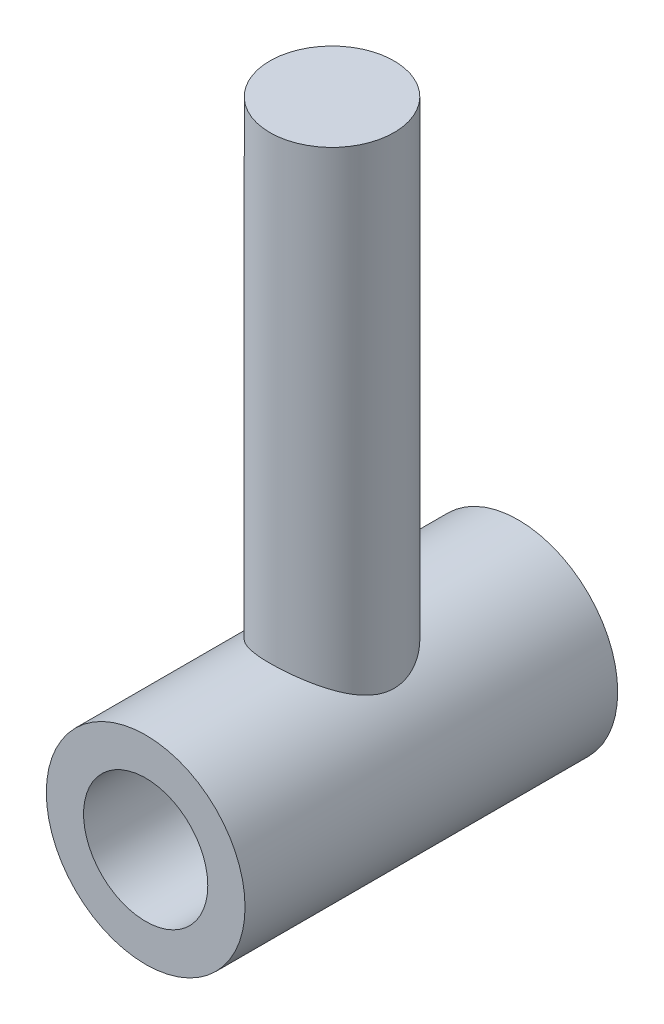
from build123d import *

# Parameters (mm, degrees)
SKETCH1_R                = 8
SKETCH1_R_2              = 5
EXTRUDE_THIN1_DEPTH      = 15
BOSS_EXTRUDE1_REACH      = 65.788
BOSS_EXTRUDE1_END_RADIUS = 8
BOSS_EXTRUDE1_START      = 45
SKETCH2_R                = 5


with BuildPart() as part:
    # Sketch1 → Extrude-Thin1 (new, symmetric)
    with BuildSketch(Plane.XY):
        Circle(SKETCH1_R)
        Circle(SKETCH1_R_2, mode=Mode.SUBTRACT)
    extrude(amount=EXTRUDE_THIN1_DEPTH, both=True)

    # Boss-Extrude1: up to this cylinder (the profile starts outside it)
    boss_extrude1_end = Plane(origin=(0, 0, 0), z_dir=(0, 0, -1)) * Cylinder(BOSS_EXTRUDE1_END_RADIUS, 148.576, mode=Mode.PRIVATE)
    # Sketch2 → Boss-Extrude1 (add, up to the surface)
    with BuildSketch(Plane(origin=(0, 0, 0), x_dir=(1, 0, 0), z_dir=(0, 1, 0)).offset(BOSS_EXTRUDE1_START), mode=Mode.PRIVATE) as boss_extrude1_sk1:
        with Locations(Location((0, 0, 0), (0, 0, 270))):
            Circle(SKETCH2_R)
    boss_extrude1_tool1 = extrude(boss_extrude1_sk1.sketch, amount=-BOSS_EXTRUDE1_REACH, mode=Mode.PRIVATE) - boss_extrude1_end
    add(boss_extrude1_tool1.solids().sort_by_distance((0, 45, 0))[0])


solid = part.part
